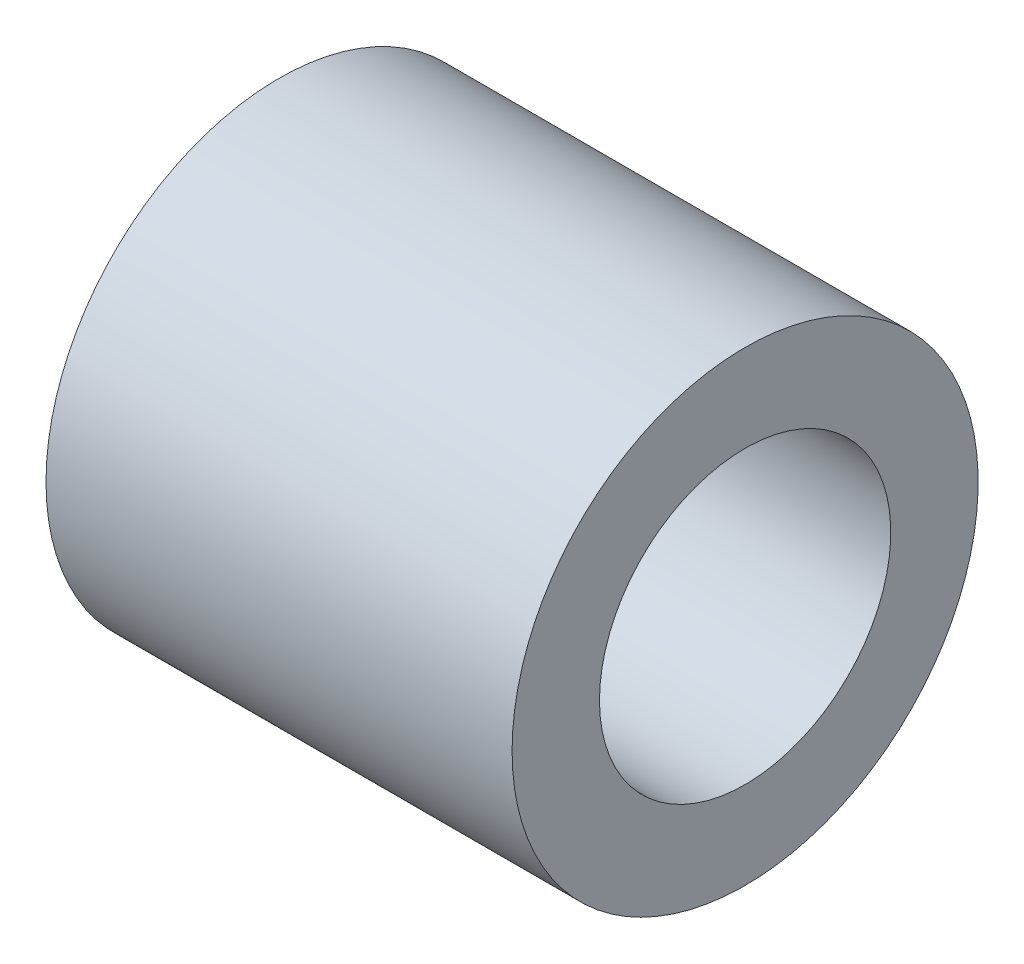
from build123d import *

# Parameters (mm, degrees)
SKIZZE1_W = 16
SKIZZE1_H = 3


with BuildPart() as part:
    # Skizze1 → Rotation2 (revolve)
    with BuildSketch(Plane.XY, mode=Mode.PRIVATE) as rotation2_sk:
        with Locations((8, 6.5)):
            Rectangle(SKIZZE1_W, SKIZZE1_H)
    revolve(rotation2_sk.sketch.rotate(Axis((0, 0, 0), (1, 0, 0)), 90), axis=Axis((0, 0, 0), (1, 0, 0)))


solid = part.part
